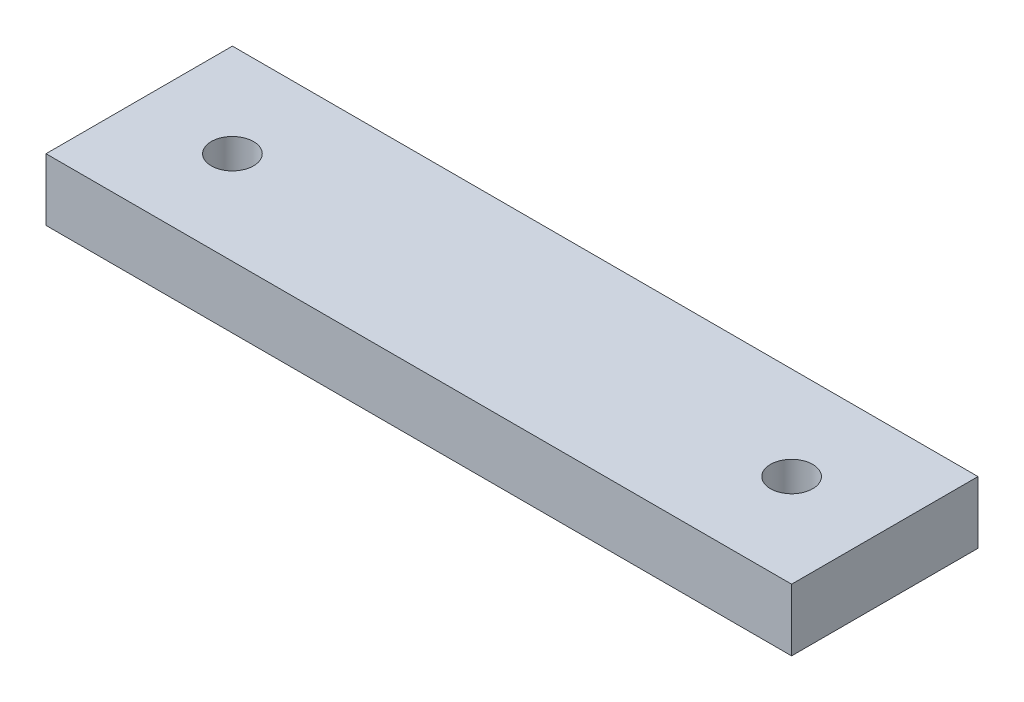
from build123d import *

# Parameters (mm, degrees)
ESQUISSE1_W       = 120
ESQUISSE1_H       = 30
EXTRUSION1_DEPTH  = 10
TROU_TARAUD_M81_D = 6.8


with BuildPart() as part:
    # Esquisse1 → Extrusion1 (new body)
    with BuildSketch(Plane(origin=(0, 0, 0), x_dir=(1, 0, 0), z_dir=(0, 1, 0))):
        Rectangle(ESQUISSE1_W, ESQUISSE1_H)
    extrude(amount=EXTRUSION1_DEPTH)

    # Trou taraud_ M81 (through all)
    with Locations(Plane(origin=(0, 10, 0), x_dir=(-1, 0, 0), z_dir=(0, 1, 0))):
        with Locations((45, 0), (-45, 0)):
            Hole(TROU_TARAUD_M81_D / 2)


solid = part.part
